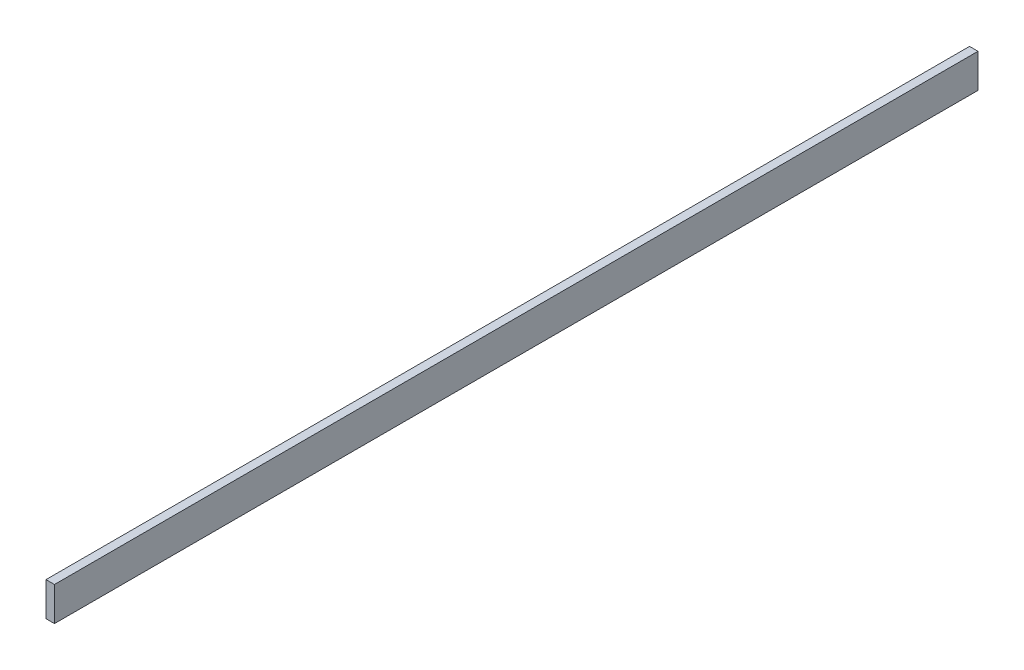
from build123d import *

# Parameters (mm, degrees)
ESQUISSE1_W      = 5
ESQUISSE1_H      = 20
EXTRUSION1_DEPTH = 545


with BuildPart() as part:
    # Esquisse1 → Extrusion1 (new body)
    with BuildSketch(Plane.XY):
        with Locations((0, 10)):
            Rectangle(ESQUISSE1_W, ESQUISSE1_H)
    extrude(amount=EXTRUSION1_DEPTH)


solid = part.part
